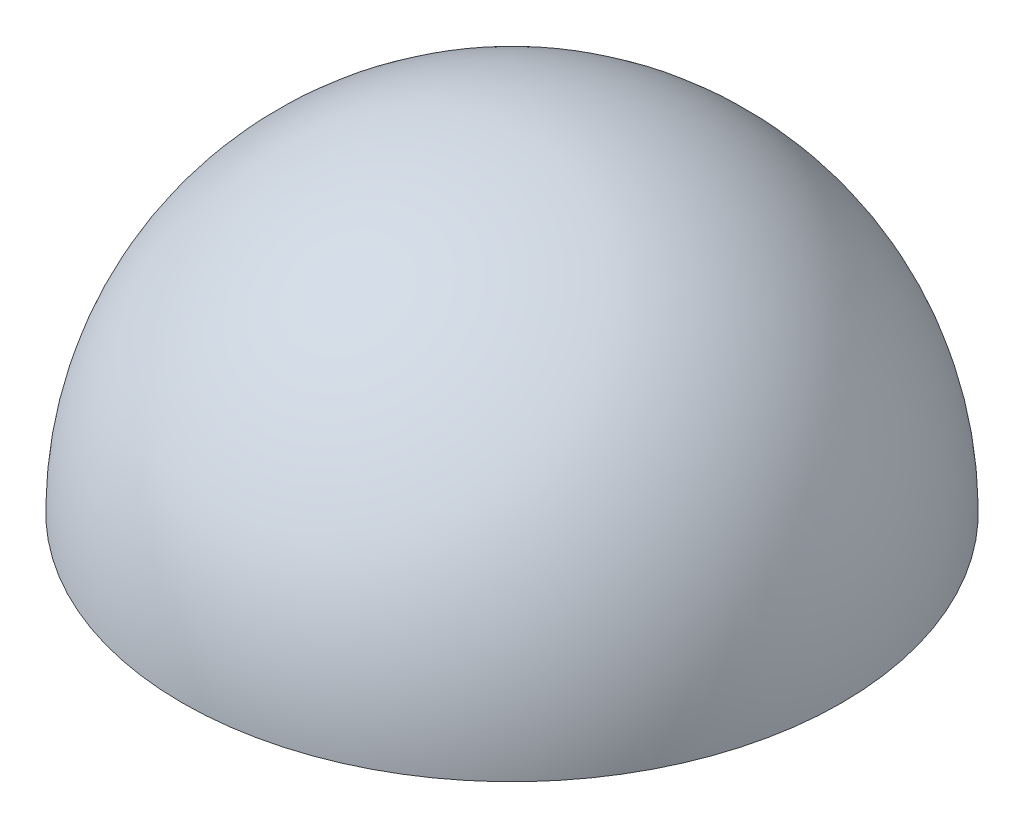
ISO-10303-21;
HEADER;
FILE_DESCRIPTION(('STEP AP214'),'2;1');
FILE_NAME('part.step','',(''),(''),'','','');
FILE_SCHEMA(('AUTOMOTIVE_DESIGN { 1 0 10303 214 1 1 1 1 }'));
ENDSEC;
DATA;
#1=APPLICATION_CONTEXT('core data for automotive mechanical design processes');
#2=APPLICATION_PROTOCOL_DEFINITION('international standard','automotive_design',2000,#1);
#3=PRODUCT_CONTEXT('',#1,'mechanical');
#4=PRODUCT('Part','Part','',(#3));
#5=PRODUCT_RELATED_PRODUCT_CATEGORY('part','',(#4));
#6=PRODUCT_DEFINITION_FORMATION('','',#4);
#7=PRODUCT_DEFINITION_CONTEXT('part definition',#1,'design');
#8=PRODUCT_DEFINITION('design','',#6,#7);
#9=PRODUCT_DEFINITION_SHAPE('','',#8);
#10=(LENGTH_UNIT() NAMED_UNIT(*) SI_UNIT(.MILLI.,.METRE.));
#11=(NAMED_UNIT(*) PLANE_ANGLE_UNIT() SI_UNIT($,.RADIAN.));
#12=(NAMED_UNIT(*) SI_UNIT($,.STERADIAN.) SOLID_ANGLE_UNIT());
#13=UNCERTAINTY_MEASURE_WITH_UNIT(LENGTH_MEASURE(1.E-05),#10,'distance_accuracy_value','');
#14=(GEOMETRIC_REPRESENTATION_CONTEXT(3) GLOBAL_UNCERTAINTY_ASSIGNED_CONTEXT((#13)) GLOBAL_UNIT_ASSIGNED_CONTEXT((#10,
#11,#12)) REPRESENTATION_CONTEXT('',''));
#15=CARTESIAN_POINT('',(0.,0.,0.));
#16=DIRECTION('',(0.,0.,1.));
#17=DIRECTION('',(1.,0.,0.));
#18=AXIS2_PLACEMENT_3D('',#15,#16,#17);
#19=CARTESIAN_POINT('',(0.,0.,0.));
#20=DIRECTION('',(0.,1.,0.));
#21=DIRECTION('',(0.,0.,1.));
#22=AXIS2_PLACEMENT_3D('',#19,#20,#21);
#23=PLANE('',#22);
#24=CARTESIAN_POINT('',(0.,0.,0.));
#25=DIRECTION('',(0.,1.,0.));
#26=DIRECTION('',(0.,0.,1.));
#27=AXIS2_PLACEMENT_3D('',#24,#25,#26);
#28=CIRCLE('',#27,40.6911409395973);
#29=CARTESIAN_POINT('',(0.,0.,40.6911409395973));
#30=VERTEX_POINT('',#29);
#31=EDGE_CURVE('E10',#30,#30,#28,.T.);
#32=ORIENTED_EDGE('',*,*,#31,.F.);
#33=EDGE_LOOP('',(#32));
#34=FACE_BOUND('',#33,.T.);
#35=ADVANCED_FACE('F38',(#34),#23,.F.);
#36=CARTESIAN_POINT('',(0.,0.,0.));
#37=DIRECTION('',(0.,1.,0.));
#38=DIRECTION('',(1.,0.,0.));
#39=AXIS2_PLACEMENT_3D('',#36,#37,#38);
#40=SPHERICAL_SURFACE('',#39,40.6911409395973);
#41=ORIENTED_EDGE('',*,*,#31,.T.);
#42=EDGE_LOOP('',(#41));
#43=FACE_BOUND('',#42,.T.);
#44=ADVANCED_FACE('F48',(#43),#40,.T.);
#45=CLOSED_SHELL('',(#35,#44));
#46=MANIFOLD_SOLID_BREP('B2',#45);
#47=ADVANCED_BREP_SHAPE_REPRESENTATION('',(#18,#46),#14);
#48=SHAPE_DEFINITION_REPRESENTATION(#9,#47);
ENDSEC;
END-ISO-10303-21;
